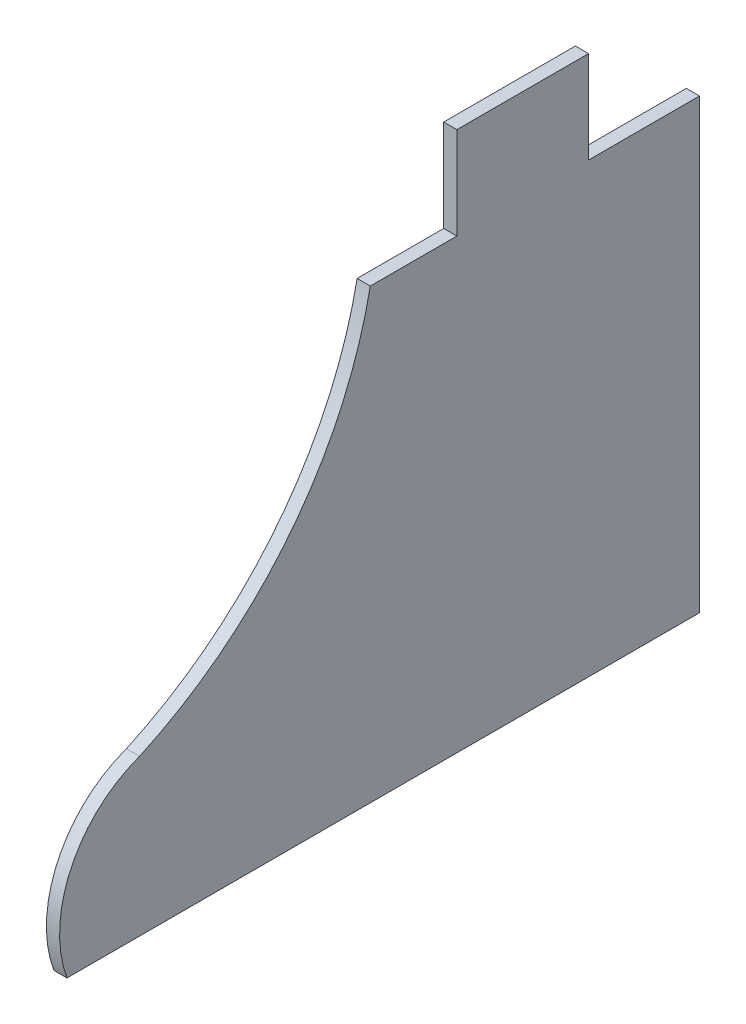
ISO-10303-21;
HEADER;
FILE_DESCRIPTION(('STEP AP214'),'2;1');
FILE_NAME('part.step','',(''),(''),'','','');
FILE_SCHEMA(('AUTOMOTIVE_DESIGN { 1 0 10303 214 1 1 1 1 }'));
ENDSEC;
DATA;
#1=APPLICATION_CONTEXT('core data for automotive mechanical design processes');
#2=APPLICATION_PROTOCOL_DEFINITION('international standard','automotive_design',2000,#1);
#3=PRODUCT_CONTEXT('',#1,'mechanical');
#4=PRODUCT('Part','Part','',(#3));
#5=PRODUCT_RELATED_PRODUCT_CATEGORY('part','',(#4));
#6=PRODUCT_DEFINITION_FORMATION('','',#4);
#7=PRODUCT_DEFINITION_CONTEXT('part definition',#1,'design');
#8=PRODUCT_DEFINITION('design','',#6,#7);
#9=PRODUCT_DEFINITION_SHAPE('','',#8);
#10=(LENGTH_UNIT() NAMED_UNIT(*) SI_UNIT(.MILLI.,.METRE.));
#11=(NAMED_UNIT(*) PLANE_ANGLE_UNIT() SI_UNIT($,.RADIAN.));
#12=(NAMED_UNIT(*) SI_UNIT($,.STERADIAN.) SOLID_ANGLE_UNIT());
#13=UNCERTAINTY_MEASURE_WITH_UNIT(LENGTH_MEASURE(1.E-05),#10,'distance_accuracy_value','');
#14=(GEOMETRIC_REPRESENTATION_CONTEXT(3) GLOBAL_UNCERTAINTY_ASSIGNED_CONTEXT((#13)) GLOBAL_UNIT_ASSIGNED_CONTEXT((#10,
#11,#12)) REPRESENTATION_CONTEXT('',''));
#15=CARTESIAN_POINT('',(0.,0.,0.));
#16=DIRECTION('',(0.,0.,1.));
#17=DIRECTION('',(1.,0.,0.));
#18=AXIS2_PLACEMENT_3D('',#15,#16,#17);
#19=CARTESIAN_POINT('',(10.,-736.674565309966,83.8466838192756));
#20=DIRECTION('',(-1.,0.,0.));
#21=DIRECTION('',(0.,0.,1.));
#22=AXIS2_PLACEMENT_3D('',#19,#20,#21);
#23=CYLINDRICAL_SURFACE('',#22,92.1635376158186);
#24=CARTESIAN_POINT('',(0.,-736.674565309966,83.8466838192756));
#25=DIRECTION('',(1.,0.,0.));
#26=DIRECTION('',(0.,0.,-1.));
#27=AXIS2_PLACEMENT_3D('',#24,#25,#26);
#28=CIRCLE('',#27,92.1635376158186);
#29=CARTESIAN_POINT('',(0.,-650.033307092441,115.269765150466));
#30=VERTEX_POINT('',#29);
#31=CARTESIAN_POINT('',(0.,-768.321686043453,170.406359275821));
#32=VERTEX_POINT('',#31);
#33=EDGE_CURVE('E137',#30,#32,#28,.T.);
#34=ORIENTED_EDGE('',*,*,#33,.T.);
#35=DIRECTION('',(-1.,0.,0.));
#36=VECTOR('',#35,1.);
#37=CARTESIAN_POINT('',(10.,-768.321686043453,170.406359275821));
#38=LINE('',#37,#36);
#39=CARTESIAN_POINT('',(10.,-768.321686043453,170.406359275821));
#40=VERTEX_POINT('',#39);
#41=EDGE_CURVE('E11',#40,#32,#38,.T.);
#42=ORIENTED_EDGE('',*,*,#41,.F.);
#43=CARTESIAN_POINT('',(10.,-736.674565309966,83.8466838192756));
#44=DIRECTION('',(1.,0.,0.));
#45=DIRECTION('',(0.,0.,-1.));
#46=AXIS2_PLACEMENT_3D('',#43,#44,#45);
#47=CIRCLE('',#46,92.1635376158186);
#48=CARTESIAN_POINT('',(10.,-650.033307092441,115.269765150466));
#49=VERTEX_POINT('',#48);
#50=EDGE_CURVE('E153',#49,#40,#47,.T.);
#51=ORIENTED_EDGE('',*,*,#50,.F.);
#52=DIRECTION('',(-1.,0.,0.));
#53=VECTOR('',#52,1.);
#54=CARTESIAN_POINT('',(10.,-650.033307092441,115.269765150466));
#55=LINE('',#54,#53);
#56=EDGE_CURVE('E133',#49,#30,#55,.T.);
#57=ORIENTED_EDGE('',*,*,#56,.T.);
#58=EDGE_LOOP('',(#34,#42,#51,#57));
#59=FACE_BOUND('',#58,.T.);
#60=ADVANCED_FACE('F35',(#59),#23,.T.);
#61=CARTESIAN_POINT('',(10.,-768.321686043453,170.406359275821));
#62=DIRECTION('',(0.,1.,0.));
#63=DIRECTION('',(0.,0.,1.));
#64=AXIS2_PLACEMENT_3D('',#61,#62,#63);
#65=PLANE('',#64);
#66=DIRECTION('',(0.,0.,-1.));
#67=VECTOR('',#66,1.);
#68=CARTESIAN_POINT('',(0.,-768.321686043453,170.406359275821));
#69=LINE('',#68,#67);
#70=CARTESIAN_POINT('',(0.,-768.321686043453,-310.083640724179));
#71=VERTEX_POINT('',#70);
#72=EDGE_CURVE('E140',#32,#71,#69,.T.);
#73=ORIENTED_EDGE('',*,*,#72,.T.);
#74=DIRECTION('',(-1.,0.,0.));
#75=VECTOR('',#74,1.);
#76=CARTESIAN_POINT('',(10.,-768.321686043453,-310.083640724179));
#77=LINE('',#76,#75);
#78=CARTESIAN_POINT('',(10.,-768.321686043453,-310.083640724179));
#79=VERTEX_POINT('',#78);
#80=EDGE_CURVE('E43',#79,#71,#77,.T.);
#81=ORIENTED_EDGE('',*,*,#80,.F.);
#82=DIRECTION('',(0.,0.,-1.));
#83=VECTOR('',#82,1.);
#84=CARTESIAN_POINT('',(10.,-768.321686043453,170.406359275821));
#85=LINE('',#84,#83);
#86=EDGE_CURVE('E97',#40,#79,#85,.T.);
#87=ORIENTED_EDGE('',*,*,#86,.F.);
#88=ORIENTED_EDGE('',*,*,#41,.T.);
#89=EDGE_LOOP('',(#73,#81,#87,#88));
#90=FACE_BOUND('',#89,.T.);
#91=ADVANCED_FACE('F196',(#90),#65,.F.);
#92=CARTESIAN_POINT('',(10.,-428.321686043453,-310.083640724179));
#93=DIRECTION('',(0.,0.,1.));
#94=DIRECTION('',(1.,0.,0.));
#95=AXIS2_PLACEMENT_3D('',#92,#93,#94);
#96=PLANE('',#95);
#97=DIRECTION('',(0.,1.,0.));
#98=VECTOR('',#97,1.);
#99=CARTESIAN_POINT('',(0.,-428.321686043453,-310.083640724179));
#100=LINE('',#99,#98);
#101=CARTESIAN_POINT('',(0.,-428.321686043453,-310.083640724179));
#102=VERTEX_POINT('',#101);
#103=EDGE_CURVE('E142',#71,#102,#100,.T.);
#104=ORIENTED_EDGE('',*,*,#103,.T.);
#105=DIRECTION('',(-1.,0.,0.));
#106=VECTOR('',#105,1.);
#107=CARTESIAN_POINT('',(10.,-428.321686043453,-310.083640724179));
#108=LINE('',#107,#106);
#109=CARTESIAN_POINT('',(10.,-428.321686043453,-310.083640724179));
#110=VERTEX_POINT('',#109);
#111=EDGE_CURVE('E163',#110,#102,#108,.T.);
#112=ORIENTED_EDGE('',*,*,#111,.F.);
#113=DIRECTION('',(0.,1.,0.));
#114=VECTOR('',#113,1.);
#115=CARTESIAN_POINT('',(10.,-428.321686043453,-310.083640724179));
#116=LINE('',#115,#114);
#117=EDGE_CURVE('E171',#79,#110,#116,.T.);
#118=ORIENTED_EDGE('',*,*,#117,.F.);
#119=ORIENTED_EDGE('',*,*,#80,.T.);
#120=EDGE_LOOP('',(#104,#112,#118,#119));
#121=FACE_BOUND('',#120,.T.);
#122=ADVANCED_FACE('F169',(#121),#96,.F.);
#123=CARTESIAN_POINT('',(10.,-428.321686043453,-225.796686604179));
#124=DIRECTION('',(0.,-1.,0.));
#125=DIRECTION('',(0.,0.,-1.));
#126=AXIS2_PLACEMENT_3D('',#123,#124,#125);
#127=PLANE('',#126);
#128=DIRECTION('',(0.,0.,1.));
#129=VECTOR('',#128,1.);
#130=CARTESIAN_POINT('',(0.,-428.321686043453,-225.796686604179));
#131=LINE('',#130,#129);
#132=CARTESIAN_POINT('',(0.,-428.321686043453,-225.796686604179));
#133=VERTEX_POINT('',#132);
#134=EDGE_CURVE('E144',#102,#133,#131,.T.);
#135=ORIENTED_EDGE('',*,*,#134,.T.);
#136=DIRECTION('',(-1.,0.,0.));
#137=VECTOR('',#136,1.);
#138=CARTESIAN_POINT('',(10.,-428.321686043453,-225.796686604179));
#139=LINE('',#138,#137);
#140=CARTESIAN_POINT('',(10.,-428.321686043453,-225.796686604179));
#141=VERTEX_POINT('',#140);
#142=EDGE_CURVE('E160',#141,#133,#139,.T.);
#143=ORIENTED_EDGE('',*,*,#142,.F.);
#144=DIRECTION('',(0.,0.,1.));
#145=VECTOR('',#144,1.);
#146=CARTESIAN_POINT('',(10.,-428.321686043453,-225.796686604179));
#147=LINE('',#146,#145);
#148=EDGE_CURVE('E187',#110,#141,#147,.T.);
#149=ORIENTED_EDGE('',*,*,#148,.F.);
#150=ORIENTED_EDGE('',*,*,#111,.T.);
#151=EDGE_LOOP('',(#135,#143,#149,#150));
#152=FACE_BOUND('',#151,.T.);
#153=ADVANCED_FACE('F180',(#152),#127,.F.);
#154=CARTESIAN_POINT('',(10.,-358.301686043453,-225.796686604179));
#155=DIRECTION('',(0.,0.,1.));
#156=DIRECTION('',(1.,0.,0.));
#157=AXIS2_PLACEMENT_3D('',#154,#155,#156);
#158=PLANE('',#157);
#159=DIRECTION('',(0.,1.,0.));
#160=VECTOR('',#159,1.);
#161=CARTESIAN_POINT('',(0.,-358.301686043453,-225.796686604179));
#162=LINE('',#161,#160);
#163=CARTESIAN_POINT('',(0.,-358.301686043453,-225.796686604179));
#164=VERTEX_POINT('',#163);
#165=EDGE_CURVE('E146',#133,#164,#162,.T.);
#166=ORIENTED_EDGE('',*,*,#165,.T.);
#167=DIRECTION('',(-1.,0.,0.));
#168=VECTOR('',#167,1.);
#169=CARTESIAN_POINT('',(10.,-358.301686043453,-225.796686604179));
#170=LINE('',#169,#168);
#171=CARTESIAN_POINT('',(10.,-358.301686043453,-225.796686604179));
#172=VERTEX_POINT('',#171);
#173=EDGE_CURVE('E157',#172,#164,#170,.T.);
#174=ORIENTED_EDGE('',*,*,#173,.F.);
#175=DIRECTION('',(0.,1.,0.));
#176=VECTOR('',#175,1.);
#177=CARTESIAN_POINT('',(10.,-358.301686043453,-225.796686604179));
#178=LINE('',#177,#176);
#179=EDGE_CURVE('E186',#141,#172,#178,.T.);
#180=ORIENTED_EDGE('',*,*,#179,.F.);
#181=ORIENTED_EDGE('',*,*,#142,.T.);
#182=EDGE_LOOP('',(#166,#174,#180,#181));
#183=FACE_BOUND('',#182,.T.);
#184=ADVANCED_FACE('F184',(#183),#158,.F.);
#185=CARTESIAN_POINT('',(10.,-358.301686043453,-225.796686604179));
#186=DIRECTION('',(0.,-1.,0.));
#187=DIRECTION('',(0.,0.,-1.));
#188=AXIS2_PLACEMENT_3D('',#185,#186,#187);
#189=PLANE('',#188);
#190=DIRECTION('',(0.,0.,1.));
#191=VECTOR('',#190,1.);
#192=CARTESIAN_POINT('',(0.,-358.301686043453,-225.796686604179));
#193=LINE('',#192,#191);
#194=CARTESIAN_POINT('',(0.,-358.301686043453,-125.776686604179));
#195=VERTEX_POINT('',#194);
#196=EDGE_CURVE('E148',#164,#195,#193,.T.);
#197=ORIENTED_EDGE('',*,*,#196,.T.);
#198=DIRECTION('',(-1.,0.,0.));
#199=VECTOR('',#198,1.);
#200=CARTESIAN_POINT('',(10.,-358.301686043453,-125.776686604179));
#201=LINE('',#200,#199);
#202=CARTESIAN_POINT('',(10.,-358.301686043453,-125.776686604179));
#203=VERTEX_POINT('',#202);
#204=EDGE_CURVE('E128',#203,#195,#201,.T.);
#205=ORIENTED_EDGE('',*,*,#204,.F.);
#206=DIRECTION('',(0.,0.,1.));
#207=VECTOR('',#206,1.);
#208=CARTESIAN_POINT('',(10.,-358.301686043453,-225.796686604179));
#209=LINE('',#208,#207);
#210=EDGE_CURVE('E119',#172,#203,#209,.T.);
#211=ORIENTED_EDGE('',*,*,#210,.F.);
#212=ORIENTED_EDGE('',*,*,#173,.T.);
#213=EDGE_LOOP('',(#197,#205,#211,#212));
#214=FACE_BOUND('',#213,.T.);
#215=ADVANCED_FACE('F208',(#214),#189,.F.);
#216=CARTESIAN_POINT('',(10.,-358.301686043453,-125.776686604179));
#217=DIRECTION('',(0.,0.,-1.));
#218=DIRECTION('',(-1.,0.,0.));
#219=AXIS2_PLACEMENT_3D('',#216,#217,#218);
#220=PLANE('',#219);
#221=DIRECTION('',(0.,-1.,0.));
#222=VECTOR('',#221,1.);
#223=CARTESIAN_POINT('',(0.,-358.301686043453,-125.776686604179));
#224=LINE('',#223,#222);
#225=CARTESIAN_POINT('',(0.,-428.321686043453,-125.776686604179));
#226=VERTEX_POINT('',#225);
#227=EDGE_CURVE('E127',#195,#226,#224,.T.);
#228=ORIENTED_EDGE('',*,*,#227,.T.);
#229=DIRECTION('',(-1.,0.,0.));
#230=VECTOR('',#229,1.);
#231=CARTESIAN_POINT('',(10.,-428.321686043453,-125.776686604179));
#232=LINE('',#231,#230);
#233=CARTESIAN_POINT('',(10.,-428.321686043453,-125.776686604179));
#234=VERTEX_POINT('',#233);
#235=EDGE_CURVE('E124',#234,#226,#232,.T.);
#236=ORIENTED_EDGE('',*,*,#235,.F.);
#237=DIRECTION('',(0.,-1.,0.));
#238=VECTOR('',#237,1.);
#239=CARTESIAN_POINT('',(10.,-358.301686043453,-125.776686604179));
#240=LINE('',#239,#238);
#241=EDGE_CURVE('E113',#203,#234,#240,.T.);
#242=ORIENTED_EDGE('',*,*,#241,.F.);
#243=ORIENTED_EDGE('',*,*,#204,.T.);
#244=EDGE_LOOP('',(#228,#236,#242,#243));
#245=FACE_BOUND('',#244,.T.);
#246=ADVANCED_FACE('F125',(#245),#220,.F.);
#247=CARTESIAN_POINT('',(10.,-428.321686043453,-125.776686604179));
#248=DIRECTION('',(0.,-1.,0.));
#249=DIRECTION('',(0.,0.,-1.));
#250=AXIS2_PLACEMENT_3D('',#247,#248,#249);
#251=PLANE('',#250);
#252=DIRECTION('',(0.,0.,1.));
#253=VECTOR('',#252,1.);
#254=CARTESIAN_POINT('',(0.,-428.321686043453,-125.776686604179));
#255=LINE('',#254,#253);
#256=CARTESIAN_POINT('',(0.,-428.321686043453,-60.0014946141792));
#257=VERTEX_POINT('',#256);
#258=EDGE_CURVE('E83',#226,#257,#255,.T.);
#259=ORIENTED_EDGE('',*,*,#258,.T.);
#260=DIRECTION('',(-1.,0.,0.));
#261=VECTOR('',#260,1.);
#262=CARTESIAN_POINT('',(10.,-428.321686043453,-60.0014946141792));
#263=LINE('',#262,#261);
#264=CARTESIAN_POINT('',(10.,-428.321686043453,-60.0014946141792));
#265=VERTEX_POINT('',#264);
#266=EDGE_CURVE('E129',#265,#257,#263,.T.);
#267=ORIENTED_EDGE('',*,*,#266,.F.);
#268=DIRECTION('',(0.,0.,1.));
#269=VECTOR('',#268,1.);
#270=CARTESIAN_POINT('',(10.,-428.321686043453,-125.776686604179));
#271=LINE('',#270,#269);
#272=EDGE_CURVE('E117',#234,#265,#271,.T.);
#273=ORIENTED_EDGE('',*,*,#272,.F.);
#274=ORIENTED_EDGE('',*,*,#235,.T.);
#275=EDGE_LOOP('',(#259,#267,#273,#274));
#276=FACE_BOUND('',#275,.T.);
#277=ADVANCED_FACE('F131',(#276),#251,.F.);
#278=CARTESIAN_POINT('',(10.,-368.560271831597,243.458575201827));
#279=DIRECTION('',(-1.,0.,0.));
#280=DIRECTION('',(0.,0.,1.));
#281=AXIS2_PLACEMENT_3D('',#278,#279,#280);
#282=CYLINDRICAL_SURFACE('',#281,309.288604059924);
#283=CARTESIAN_POINT('',(0.,-368.560271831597,243.458575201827));
#284=DIRECTION('',(-1.,0.,0.));
#285=DIRECTION('',(0.,0.,-1.));
#286=AXIS2_PLACEMENT_3D('',#283,#284,#285);
#287=CIRCLE('',#286,309.288604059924);
#288=EDGE_CURVE('E89',#257,#30,#287,.T.);
#289=ORIENTED_EDGE('',*,*,#288,.T.);
#290=ORIENTED_EDGE('',*,*,#56,.F.);
#291=CARTESIAN_POINT('',(10.,-368.560271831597,243.458575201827));
#292=DIRECTION('',(-1.,0.,0.));
#293=DIRECTION('',(0.,0.,-1.));
#294=AXIS2_PLACEMENT_3D('',#291,#292,#293);
#295=CIRCLE('',#294,309.288604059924);
#296=EDGE_CURVE('E51',#265,#49,#295,.T.);
#297=ORIENTED_EDGE('',*,*,#296,.F.);
#298=ORIENTED_EDGE('',*,*,#266,.T.);
#299=EDGE_LOOP('',(#289,#290,#297,#298));
#300=FACE_BOUND('',#299,.T.);
#301=ADVANCED_FACE('F216',(#300),#282,.F.);
#302=CARTESIAN_POINT('',(10.,-736.674565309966,83.8466838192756));
#303=DIRECTION('',(1.,0.,0.));
#304=DIRECTION('',(0.,0.,-1.));
#305=AXIS2_PLACEMENT_3D('',#302,#303,#304);
#306=PLANE('',#305);
#307=ORIENTED_EDGE('',*,*,#50,.T.);
#308=ORIENTED_EDGE('',*,*,#86,.T.);
#309=ORIENTED_EDGE('',*,*,#117,.T.);
#310=ORIENTED_EDGE('',*,*,#148,.T.);
#311=ORIENTED_EDGE('',*,*,#179,.T.);
#312=ORIENTED_EDGE('',*,*,#210,.T.);
#313=ORIENTED_EDGE('',*,*,#241,.T.);
#314=ORIENTED_EDGE('',*,*,#272,.T.);
#315=ORIENTED_EDGE('',*,*,#296,.T.);
#316=EDGE_LOOP('',(#307,#308,#309,#310,#311,#312,#313,#314,#315));
#317=FACE_BOUND('',#316,.T.);
#318=ADVANCED_FACE('F115',(#317),#306,.T.);
#319=CARTESIAN_POINT('',(0.,-736.674565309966,83.8466838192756));
#320=DIRECTION('',(1.,0.,0.));
#321=DIRECTION('',(0.,0.,-1.));
#322=AXIS2_PLACEMENT_3D('',#319,#320,#321);
#323=PLANE('',#322);
#324=ORIENTED_EDGE('',*,*,#33,.F.);
#325=ORIENTED_EDGE('',*,*,#288,.F.);
#326=ORIENTED_EDGE('',*,*,#258,.F.);
#327=ORIENTED_EDGE('',*,*,#227,.F.);
#328=ORIENTED_EDGE('',*,*,#196,.F.);
#329=ORIENTED_EDGE('',*,*,#165,.F.);
#330=ORIENTED_EDGE('',*,*,#134,.F.);
#331=ORIENTED_EDGE('',*,*,#103,.F.);
#332=ORIENTED_EDGE('',*,*,#72,.F.);
#333=EDGE_LOOP('',(#324,#325,#326,#327,#328,#329,#330,#331,#332));
#334=FACE_BOUND('',#333,.T.);
#335=ADVANCED_FACE('F175',(#334),#323,.F.);
#336=CLOSED_SHELL('',(#60,#91,#122,#153,#184,#215,#246,#277,#301,#318,#335));
#337=MANIFOLD_SOLID_BREP('B2',#336);
#338=ADVANCED_BREP_SHAPE_REPRESENTATION('',(#18,#337),#14);
#339=SHAPE_DEFINITION_REPRESENTATION(#9,#338);
ENDSEC;
END-ISO-10303-21;
